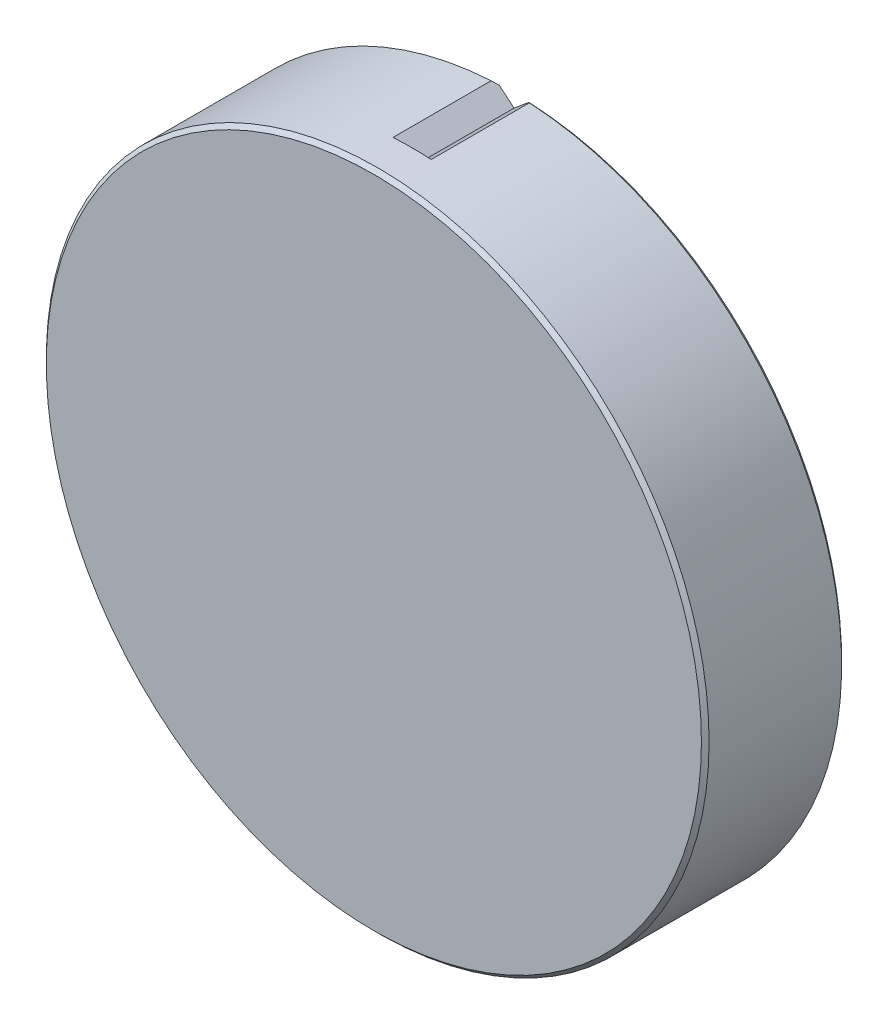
ISO-10303-21;
HEADER;
FILE_DESCRIPTION(('STEP AP214'),'2;1');
FILE_NAME('part.step','',(''),(''),'','','');
FILE_SCHEMA(('AUTOMOTIVE_DESIGN { 1 0 10303 214 1 1 1 1 }'));
ENDSEC;
DATA;
#1=APPLICATION_CONTEXT('core data for automotive mechanical design processes');
#2=APPLICATION_PROTOCOL_DEFINITION('international standard','automotive_design',2000,#1);
#3=PRODUCT_CONTEXT('',#1,'mechanical');
#4=PRODUCT('Part','Part','',(#3));
#5=PRODUCT_RELATED_PRODUCT_CATEGORY('part','',(#4));
#6=PRODUCT_DEFINITION_FORMATION('','',#4);
#7=PRODUCT_DEFINITION_CONTEXT('part definition',#1,'design');
#8=PRODUCT_DEFINITION('design','',#6,#7);
#9=PRODUCT_DEFINITION_SHAPE('','',#8);
#10=(LENGTH_UNIT() NAMED_UNIT(*) SI_UNIT(.MILLI.,.METRE.));
#11=(NAMED_UNIT(*) PLANE_ANGLE_UNIT() SI_UNIT($,.RADIAN.));
#12=(NAMED_UNIT(*) SI_UNIT($,.STERADIAN.) SOLID_ANGLE_UNIT());
#13=UNCERTAINTY_MEASURE_WITH_UNIT(LENGTH_MEASURE(1.E-05),#10,'distance_accuracy_value','');
#14=(GEOMETRIC_REPRESENTATION_CONTEXT(3) GLOBAL_UNCERTAINTY_ASSIGNED_CONTEXT((#13)) GLOBAL_UNIT_ASSIGNED_CONTEXT((#10,
#11,#12)) REPRESENTATION_CONTEXT('',''));
#15=CARTESIAN_POINT('',(0.,0.,0.));
#16=DIRECTION('',(0.,0.,1.));
#17=DIRECTION('',(1.,0.,0.));
#18=AXIS2_PLACEMENT_3D('',#15,#16,#17);
#19=CARTESIAN_POINT('',(0.,0.,-78.8));
#20=DIRECTION('',(0.,0.,1.));
#21=DIRECTION('',(1.,0.,0.));
#22=AXIS2_PLACEMENT_3D('',#19,#20,#21);
#23=PLANE('',#22);
#24=CARTESIAN_POINT('',(15.5563491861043,-15.5563491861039,-78.8));
#25=DIRECTION('',(0.,0.,-1.));
#26=DIRECTION('',(-1.,0.,0.));
#27=AXIS2_PLACEMENT_3D('',#24,#25,#26);
#28=CIRCLE('',#27,2.);
#29=CARTESIAN_POINT('',(13.5563491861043,-15.5563491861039,-78.8));
#30=VERTEX_POINT('',#29);
#31=EDGE_CURVE('E85',#30,#30,#28,.T.);
#32=ORIENTED_EDGE('',*,*,#31,.F.);
#33=EDGE_LOOP('',(#32));
#34=FACE_BOUND('',#33,.T.);
#35=CARTESIAN_POINT('',(2.24778758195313E-13,-22.,-78.8));
#36=DIRECTION('',(0.,0.,-1.));
#37=DIRECTION('',(-1.,0.,0.));
#38=AXIS2_PLACEMENT_3D('',#35,#36,#37);
#39=CIRCLE('',#38,2.);
#40=CARTESIAN_POINT('',(-1.99999999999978,-22.,-78.8));
#41=VERTEX_POINT('',#40);
#42=EDGE_CURVE('E94',#41,#41,#39,.T.);
#43=ORIENTED_EDGE('',*,*,#42,.F.);
#44=EDGE_LOOP('',(#43));
#45=FACE_BOUND('',#44,.T.);
#46=CARTESIAN_POINT('',(-22.,0.,-78.8));
#47=DIRECTION('',(0.,0.,-1.));
#48=DIRECTION('',(-1.,0.,0.));
#49=AXIS2_PLACEMENT_3D('',#46,#47,#48);
#50=CIRCLE('',#49,2.);
#51=CARTESIAN_POINT('',(-24.,0.,-78.8));
#52=VERTEX_POINT('',#51);
#53=EDGE_CURVE('E103',#52,#52,#50,.T.);
#54=ORIENTED_EDGE('',*,*,#53,.F.);
#55=EDGE_LOOP('',(#54));
#56=FACE_BOUND('',#55,.T.);
#57=CARTESIAN_POINT('',(-15.5563491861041,15.556349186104,-78.8));
#58=DIRECTION('',(0.,0.,-1.));
#59=DIRECTION('',(-1.,0.,0.));
#60=AXIS2_PLACEMENT_3D('',#57,#58,#59);
#61=CIRCLE('',#60,2.);
#62=CARTESIAN_POINT('',(-17.5563491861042,15.556349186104,-78.8));
#63=VERTEX_POINT('',#62);
#64=EDGE_CURVE('E112',#63,#63,#61,.T.);
#65=ORIENTED_EDGE('',*,*,#64,.F.);
#66=EDGE_LOOP('',(#65));
#67=FACE_BOUND('',#66,.T.);
#68=CARTESIAN_POINT('',(0.,22.,-78.8));
#69=DIRECTION('',(0.,0.,-1.));
#70=DIRECTION('',(-1.,0.,0.));
#71=AXIS2_PLACEMENT_3D('',#68,#69,#70);
#72=CIRCLE('',#71,2.);
#73=CARTESIAN_POINT('',(-2.00000000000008,22.,-78.8));
#74=VERTEX_POINT('',#73);
#75=EDGE_CURVE('E121',#74,#74,#72,.T.);
#76=ORIENTED_EDGE('',*,*,#75,.F.);
#77=EDGE_LOOP('',(#76));
#78=FACE_BOUND('',#77,.T.);
#79=CARTESIAN_POINT('',(22.,0.,-78.8));
#80=DIRECTION('',(0.,0.,-1.));
#81=DIRECTION('',(-1.,0.,0.));
#82=AXIS2_PLACEMENT_3D('',#79,#80,#81);
#83=CIRCLE('',#82,2.);
#84=CARTESIAN_POINT('',(20.,0.,-78.8));
#85=VERTEX_POINT('',#84);
#86=EDGE_CURVE('E130',#85,#85,#83,.T.);
#87=ORIENTED_EDGE('',*,*,#86,.F.);
#88=EDGE_LOOP('',(#87));
#89=FACE_BOUND('',#88,.T.);
#90=CARTESIAN_POINT('',(-15.5563491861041,-15.556349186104,-78.8));
#91=DIRECTION('',(0.,0.,-1.));
#92=DIRECTION('',(-1.,0.,0.));
#93=AXIS2_PLACEMENT_3D('',#90,#91,#92);
#94=CIRCLE('',#93,2.);
#95=CARTESIAN_POINT('',(-17.5563491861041,-15.556349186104,-78.8));
#96=VERTEX_POINT('',#95);
#97=EDGE_CURVE('E139',#96,#96,#94,.T.);
#98=ORIENTED_EDGE('',*,*,#97,.F.);
#99=EDGE_LOOP('',(#98));
#100=FACE_BOUND('',#99,.T.);
#101=CARTESIAN_POINT('',(15.556349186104,15.556349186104,-78.8));
#102=DIRECTION('',(0.,0.,-1.));
#103=DIRECTION('',(-1.,0.,0.));
#104=AXIS2_PLACEMENT_3D('',#101,#102,#103);
#105=CIRCLE('',#104,2.);
#106=CARTESIAN_POINT('',(13.556349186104,15.556349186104,-78.8));
#107=VERTEX_POINT('',#106);
#108=EDGE_CURVE('E145',#107,#107,#105,.T.);
#109=ORIENTED_EDGE('',*,*,#108,.F.);
#110=EDGE_LOOP('',(#109));
#111=FACE_BOUND('',#110,.T.);
#112=CARTESIAN_POINT('',(0.,0.,-78.8));
#113=DIRECTION('',(0.,0.,1.));
#114=DIRECTION('',(1.,0.,0.));
#115=AXIS2_PLACEMENT_3D('',#112,#113,#114);
#116=CIRCLE('',#115,17.5);
#117=CARTESIAN_POINT('',(17.5,0.,-78.8));
#118=VERTEX_POINT('',#117);
#119=EDGE_CURVE('E164',#118,#118,#116,.T.);
#120=ORIENTED_EDGE('',*,*,#119,.T.);
#121=EDGE_LOOP('',(#120));
#122=FACE_BOUND('',#121,.T.);
#123=CARTESIAN_POINT('',(0.,0.,-78.8));
#124=DIRECTION('',(0.,0.,1.));
#125=DIRECTION('',(1.,0.,0.));
#126=AXIS2_PLACEMENT_3D('',#123,#124,#125);
#127=CIRCLE('',#126,25.7);
#128=CARTESIAN_POINT('',(1.16272163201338,25.6736845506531,-78.8));
#129=VERTEX_POINT('',#128);
#130=CARTESIAN_POINT('',(-1.16272163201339,25.6736845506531,-78.8));
#131=VERTEX_POINT('',#130);
#132=EDGE_CURVE('E155',#129,#131,#127,.F.);
#133=ORIENTED_EDGE('',*,*,#132,.T.);
#134=DIRECTION('',(-0.766044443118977,0.64278760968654,0.));
#135=VECTOR('',#134,1.);
#136=CARTESIAN_POINT('',(0.,24.6980452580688,-78.8));
#137=LINE('',#136,#135);
#138=CARTESIAN_POINT('',(0.,24.6980452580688,-78.8));
#139=VERTEX_POINT('',#138);
#140=EDGE_CURVE('E72',#139,#131,#137,.T.);
#141=ORIENTED_EDGE('',*,*,#140,.F.);
#142=DIRECTION('',(-0.766044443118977,-0.64278760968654,0.));
#143=VECTOR('',#142,1.);
#144=CARTESIAN_POINT('',(1.5,25.9566947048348,-78.8));
#145=LINE('',#144,#143);
#146=EDGE_CURVE('E596',#129,#139,#145,.T.);
#147=ORIENTED_EDGE('',*,*,#146,.F.);
#148=EDGE_LOOP('',(#133,#141,#147));
#149=FACE_BOUND('',#148,.T.);
#150=ADVANCED_FACE('F18',(#34,#45,#56,#67,#78,#89,#100,#111,#122,#149),#23,.F.);
#151=CARTESIAN_POINT('',(0.,0.,-67.8));
#152=DIRECTION('',(0.,0.,-1.));
#153=DIRECTION('',(-1.,0.,0.));
#154=AXIS2_PLACEMENT_3D('',#151,#152,#153);
#155=CYLINDRICAL_SURFACE('',#154,26.);
#156=CARTESIAN_POINT('',(0.,0.,-70.8));
#157=DIRECTION('',(0.,0.,1.));
#158=DIRECTION('',(1.,0.,0.));
#159=AXIS2_PLACEMENT_3D('',#156,#157,#158);
#160=CIRCLE('',#159,26.);
#161=CARTESIAN_POINT('',(1.5,25.9566947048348,-70.8));
#162=VERTEX_POINT('',#161);
#163=CARTESIAN_POINT('',(-1.5,25.9566947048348,-70.8));
#164=VERTEX_POINT('',#163);
#165=EDGE_CURVE('E11',#162,#164,#160,.T.);
#166=ORIENTED_EDGE('',*,*,#165,.T.);
#167=DIRECTION('',(0.,0.,-1.));
#168=VECTOR('',#167,1.);
#169=CARTESIAN_POINT('',(-1.5,25.9566947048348,-70.8));
#170=LINE('',#169,#168);
#171=CARTESIAN_POINT('',(-1.5,25.9566947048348,-78.5));
#172=VERTEX_POINT('',#171);
#173=EDGE_CURVE('E80',#164,#172,#170,.T.);
#174=ORIENTED_EDGE('',*,*,#173,.T.);
#175=CARTESIAN_POINT('',(0.,0.,-78.5));
#176=DIRECTION('',(0.,0.,1.));
#177=DIRECTION('',(1.,0.,0.));
#178=AXIS2_PLACEMENT_3D('',#175,#176,#177);
#179=CIRCLE('',#178,26.);
#180=CARTESIAN_POINT('',(1.5,25.9566947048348,-78.5));
#181=VERTEX_POINT('',#180);
#182=EDGE_CURVE('E78',#172,#181,#179,.T.);
#183=ORIENTED_EDGE('',*,*,#182,.T.);
#184=DIRECTION('',(0.,0.,-1.));
#185=VECTOR('',#184,1.);
#186=CARTESIAN_POINT('',(1.5,25.9566947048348,-70.8));
#187=LINE('',#186,#185);
#188=EDGE_CURVE('E33',#162,#181,#187,.T.);
#189=ORIENTED_EDGE('',*,*,#188,.F.);
#190=EDGE_LOOP('',(#166,#174,#183,#189));
#191=FACE_BOUND('',#190,.T.);
#192=CARTESIAN_POINT('',(0.,0.,-68.1));
#193=DIRECTION('',(0.,0.,1.));
#194=DIRECTION('',(1.,0.,0.));
#195=AXIS2_PLACEMENT_3D('',#192,#193,#194);
#196=CIRCLE('',#195,26.);
#197=CARTESIAN_POINT('',(26.,0.,-68.1));
#198=VERTEX_POINT('',#197);
#199=EDGE_CURVE('E151',#198,#198,#196,.F.);
#200=ORIENTED_EDGE('',*,*,#199,.T.);
#201=EDGE_LOOP('',(#200));
#202=FACE_BOUND('',#201,.T.);
#203=ADVANCED_FACE('F75',(#191,#202),#155,.T.);
#204=CARTESIAN_POINT('',(0.,0.,-67.8));
#205=DIRECTION('',(0.,0.,1.));
#206=DIRECTION('',(1.,0.,0.));
#207=AXIS2_PLACEMENT_3D('',#204,#205,#206);
#208=PLANE('',#207);
#209=CARTESIAN_POINT('',(0.,0.,-67.8));
#210=DIRECTION('',(0.,0.,1.));
#211=DIRECTION('',(1.,0.,0.));
#212=AXIS2_PLACEMENT_3D('',#209,#210,#211);
#213=CIRCLE('',#212,25.7);
#214=CARTESIAN_POINT('',(25.7,0.,-67.8));
#215=VERTEX_POINT('',#214);
#216=EDGE_CURVE('E158',#215,#215,#213,.T.);
#217=ORIENTED_EDGE('',*,*,#216,.T.);
#218=EDGE_LOOP('',(#217));
#219=FACE_BOUND('',#218,.T.);
#220=ADVANCED_FACE('F294',(#219),#208,.T.);
#221=CARTESIAN_POINT('',(0.,0.,-78.5));
#222=DIRECTION('',(0.,0.,1.));
#223=DIRECTION('',(1.,0.,0.));
#224=AXIS2_PLACEMENT_3D('',#221,#222,#223);
#225=CONICAL_SURFACE('',#224,26.,0.785398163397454);
#226=CARTESIAN_POINT('',(-1.16249525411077,25.6734945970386,-78.8002));
#227=CARTESIAN_POINT('',(-1.21889902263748,25.7208229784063,-78.7503660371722));
#228=CARTESIAN_POINT('',(-1.27524296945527,25.7681011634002,-78.7004174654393));
#229=CARTESIAN_POINT('',(-1.38781121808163,25.8625571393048,-78.6002911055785));
#230=CARTESIAN_POINT('',(-1.44403551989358,25.9097349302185,-78.5501133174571));
#231=CARTESIAN_POINT('',(-1.5002,25.956862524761,-78.499820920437));
#232=B_SPLINE_CURVE_WITH_KNOTS('',3,(#226,#227,#228,#229,#230,#231),.UNSPECIFIED.,.F.,.F.,(4,2,
4),(0.,0.266725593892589,0.53345118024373),.UNSPECIFIED.);
#233=EDGE_CURVE('E26',#131,#172,#232,.T.);
#234=ORIENTED_EDGE('',*,*,#233,.F.);
#235=ORIENTED_EDGE('',*,*,#132,.F.);
#236=CARTESIAN_POINT('',(1.5002,25.956862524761,-78.499820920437));
#237=CARTESIAN_POINT('',(1.44403551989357,25.9097349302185,-78.5501133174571));
#238=CARTESIAN_POINT('',(1.38781121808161,25.8625571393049,-78.6002911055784));
#239=CARTESIAN_POINT('',(1.27524296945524,25.7681011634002,-78.7004174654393));
#240=CARTESIAN_POINT('',(1.21889902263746,25.7208229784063,-78.7503660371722));
#241=CARTESIAN_POINT('',(1.16249525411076,25.6734945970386,-78.8002));
#242=B_SPLINE_CURVE_WITH_KNOTS('',3,(#236,#237,#238,#239,#240,#241),.UNSPECIFIED.,.F.,.F.,(4,2,
4),(0.,0.266725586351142,0.533451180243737),.UNSPECIFIED.);
#243=EDGE_CURVE('E173',#181,#129,#242,.T.);
#244=ORIENTED_EDGE('',*,*,#243,.F.);
#245=ORIENTED_EDGE('',*,*,#182,.F.);
#246=EDGE_LOOP('',(#234,#235,#244,#245));
#247=FACE_BOUND('',#246,.T.);
#248=ADVANCED_FACE('F186',(#247),#225,.T.);
#249=CARTESIAN_POINT('',(0.,0.,-67.8));
#250=DIRECTION('',(0.,0.,-1.));
#251=DIRECTION('',(-1.,0.,0.));
#252=AXIS2_PLACEMENT_3D('',#249,#250,#251);
#253=CONICAL_SURFACE('',#252,25.7,0.785398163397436);
#254=ORIENTED_EDGE('',*,*,#199,.F.);
#255=EDGE_LOOP('',(#254));
#256=FACE_BOUND('',#255,.T.);
#257=ORIENTED_EDGE('',*,*,#216,.F.);
#258=EDGE_LOOP('',(#257));
#259=FACE_BOUND('',#258,.T.);
#260=ADVANCED_FACE('F292',(#256,#259),#253,.T.);
#261=CARTESIAN_POINT('',(0.,0.,-74.8));
#262=DIRECTION('',(0.,0.,1.));
#263=DIRECTION('',(1.,0.,0.));
#264=AXIS2_PLACEMENT_3D('',#261,#262,#263);
#265=PLANE('',#264);
#266=CARTESIAN_POINT('',(0.,0.,-74.8));
#267=DIRECTION('',(0.,0.,1.));
#268=DIRECTION('',(1.,0.,0.));
#269=AXIS2_PLACEMENT_3D('',#266,#267,#268);
#270=CIRCLE('',#269,16.8);
#271=CARTESIAN_POINT('',(16.8,0.,-74.8));
#272=VERTEX_POINT('',#271);
#273=EDGE_CURVE('E167',#272,#272,#270,.F.);
#274=ORIENTED_EDGE('',*,*,#273,.T.);
#275=EDGE_LOOP('',(#274));
#276=FACE_BOUND('',#275,.T.);
#277=ADVANCED_FACE('F288',(#276),#265,.F.);
#278=CARTESIAN_POINT('',(0.,0.,-23.7167388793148));
#279=DIRECTION('',(0.,0.,-1.));
#280=DIRECTION('',(-1.,0.,0.));
#281=AXIS2_PLACEMENT_3D('',#278,#279,#280);
#282=CYLINDRICAL_SURFACE('',#281,17.);
#283=CARTESIAN_POINT('',(0.,0.,-75.));
#284=DIRECTION('',(0.,0.,1.));
#285=DIRECTION('',(1.,0.,0.));
#286=AXIS2_PLACEMENT_3D('',#283,#284,#285);
#287=CIRCLE('',#286,17.);
#288=CARTESIAN_POINT('',(17.,0.,-75.));
#289=VERTEX_POINT('',#288);
#290=EDGE_CURVE('E170',#289,#289,#287,.T.);
#291=ORIENTED_EDGE('',*,*,#290,.T.);
#292=EDGE_LOOP('',(#291));
#293=FACE_BOUND('',#292,.T.);
#294=CARTESIAN_POINT('',(0.,0.,-78.3));
#295=DIRECTION('',(0.,0.,1.));
#296=DIRECTION('',(1.,0.,0.));
#297=AXIS2_PLACEMENT_3D('',#294,#295,#296);
#298=CIRCLE('',#297,17.);
#299=CARTESIAN_POINT('',(17.,0.,-78.3));
#300=VERTEX_POINT('',#299);
#301=EDGE_CURVE('E161',#300,#300,#298,.F.);
#302=ORIENTED_EDGE('',*,*,#301,.T.);
#303=EDGE_LOOP('',(#302));
#304=FACE_BOUND('',#303,.T.);
#305=ADVANCED_FACE('F284',(#293,#304),#282,.F.);
#306=CARTESIAN_POINT('',(0.,0.,-78.3));
#307=DIRECTION('',(0.,0.,-1.));
#308=DIRECTION('',(-1.,0.,0.));
#309=AXIS2_PLACEMENT_3D('',#306,#307,#308);
#310=CONICAL_SURFACE('',#309,17.,0.785398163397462);
#311=ORIENTED_EDGE('',*,*,#119,.F.);
#312=EDGE_LOOP('',(#311));
#313=FACE_BOUND('',#312,.T.);
#314=ORIENTED_EDGE('',*,*,#301,.F.);
#315=EDGE_LOOP('',(#314));
#316=FACE_BOUND('',#315,.T.);
#317=ADVANCED_FACE('F287',(#313,#316),#310,.F.);
#318=CARTESIAN_POINT('',(0.,0.,-75.));
#319=DIRECTION('',(0.,0.,1.));
#320=DIRECTION('',(1.,0.,0.));
#321=AXIS2_PLACEMENT_3D('',#318,#319,#320);
#322=TOROIDAL_SURFACE('',#321,16.8,0.2);
#323=ORIENTED_EDGE('',*,*,#290,.F.);
#324=EDGE_LOOP('',(#323));
#325=FACE_BOUND('',#324,.T.);
#326=ORIENTED_EDGE('',*,*,#273,.F.);
#327=EDGE_LOOP('',(#326));
#328=FACE_BOUND('',#327,.T.);
#329=ADVANCED_FACE('F20',(#325,#328),#322,.F.);
#330=CARTESIAN_POINT('',(15.556349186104,15.556349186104,-73.8));
#331=DIRECTION('',(0.,0.,-1.));
#332=DIRECTION('',(-1.,0.,0.));
#333=AXIS2_PLACEMENT_3D('',#330,#331,#332);
#334=CONICAL_SURFACE('',#333,2.,1.02974425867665);
#335=CARTESIAN_POINT('',(15.556349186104,15.556349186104,-72.5982787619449));
#336=VERTEX_POINT('',#335);
#337=VERTEX_LOOP('',#336);
#338=FACE_BOUND('',#337,.T.);
#339=CARTESIAN_POINT('',(15.556349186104,15.556349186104,-73.8));
#340=DIRECTION('',(0.,0.,-1.));
#341=DIRECTION('',(-1.,0.,0.));
#342=AXIS2_PLACEMENT_3D('',#339,#340,#341);
#343=CIRCLE('',#342,2.);
#344=CARTESIAN_POINT('',(13.556349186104,15.556349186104,-73.8));
#345=VERTEX_POINT('',#344);
#346=EDGE_CURVE('E148',#345,#345,#343,.T.);
#347=ORIENTED_EDGE('',*,*,#346,.T.);
#348=EDGE_LOOP('',(#347));
#349=FACE_BOUND('',#348,.T.);
#350=ADVANCED_FACE('F280',(#338,#349),#334,.F.);
#351=CARTESIAN_POINT('',(15.556349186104,15.556349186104,-78.8));
#352=DIRECTION('',(0.,0.,-1.));
#353=DIRECTION('',(-1.,0.,0.));
#354=AXIS2_PLACEMENT_3D('',#351,#352,#353);
#355=CYLINDRICAL_SURFACE('',#354,2.);
#356=ORIENTED_EDGE('',*,*,#346,.F.);
#357=EDGE_LOOP('',(#356));
#358=FACE_BOUND('',#357,.T.);
#359=ORIENTED_EDGE('',*,*,#108,.T.);
#360=EDGE_LOOP('',(#359));
#361=FACE_BOUND('',#360,.T.);
#362=ADVANCED_FACE('F276',(#358,#361),#355,.F.);
#363=CARTESIAN_POINT('',(-15.5563491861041,-15.556349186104,-73.8));
#364=DIRECTION('',(0.,0.,-1.));
#365=DIRECTION('',(-1.,0.,0.));
#366=AXIS2_PLACEMENT_3D('',#363,#364,#365);
#367=CONICAL_SURFACE('',#366,2.,1.02974425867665);
#368=CARTESIAN_POINT('',(-15.5563491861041,-15.556349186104,-72.5982787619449));
#369=VERTEX_POINT('',#368);
#370=VERTEX_LOOP('',#369);
#371=FACE_BOUND('',#370,.T.);
#372=CARTESIAN_POINT('',(-15.5563491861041,-15.556349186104,-73.8));
#373=DIRECTION('',(0.,0.,-1.));
#374=DIRECTION('',(-1.,0.,0.));
#375=AXIS2_PLACEMENT_3D('',#372,#373,#374);
#376=CIRCLE('',#375,2.);
#377=CARTESIAN_POINT('',(-17.5563491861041,-15.556349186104,-73.8));
#378=VERTEX_POINT('',#377);
#379=EDGE_CURVE('E142',#378,#378,#376,.T.);
#380=ORIENTED_EDGE('',*,*,#379,.T.);
#381=EDGE_LOOP('',(#380));
#382=FACE_BOUND('',#381,.T.);
#383=ADVANCED_FACE('F272',(#371,#382),#367,.F.);
#384=CARTESIAN_POINT('',(-15.5563491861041,-15.556349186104,-78.8));
#385=DIRECTION('',(0.,0.,-1.));
#386=DIRECTION('',(-1.,0.,0.));
#387=AXIS2_PLACEMENT_3D('',#384,#385,#386);
#388=CYLINDRICAL_SURFACE('',#387,2.);
#389=ORIENTED_EDGE('',*,*,#379,.F.);
#390=EDGE_LOOP('',(#389));
#391=FACE_BOUND('',#390,.T.);
#392=ORIENTED_EDGE('',*,*,#97,.T.);
#393=EDGE_LOOP('',(#392));
#394=FACE_BOUND('',#393,.T.);
#395=ADVANCED_FACE('F268',(#391,#394),#388,.F.);
#396=CARTESIAN_POINT('',(22.,0.,-78.8));
#397=DIRECTION('',(0.,0.,-1.));
#398=DIRECTION('',(-1.,0.,0.));
#399=AXIS2_PLACEMENT_3D('',#396,#397,#398);
#400=CYLINDRICAL_SURFACE('',#399,1.65);
#401=CARTESIAN_POINT('',(22.,0.,-69.3));
#402=DIRECTION('',(0.,0.,1.));
#403=DIRECTION('',(1.,0.,0.));
#404=AXIS2_PLACEMENT_3D('',#401,#402,#403);
#405=CIRCLE('',#404,1.65);
#406=CARTESIAN_POINT('',(23.65,0.,-69.3));
#407=VERTEX_POINT('',#406);
#408=EDGE_CURVE('E595',#407,#407,#405,.F.);
#409=ORIENTED_EDGE('',*,*,#408,.F.);
#410=EDGE_LOOP('',(#409));
#411=FACE_BOUND('',#410,.T.);
#412=CARTESIAN_POINT('',(22.,0.,-70.8));
#413=DIRECTION('',(0.,0.,-1.));
#414=DIRECTION('',(-1.,0.,0.));
#415=AXIS2_PLACEMENT_3D('',#412,#413,#414);
#416=CIRCLE('',#415,1.65);
#417=CARTESIAN_POINT('',(20.35,0.,-70.8));
#418=VERTEX_POINT('',#417);
#419=EDGE_CURVE('E136',#418,#418,#416,.T.);
#420=ORIENTED_EDGE('',*,*,#419,.T.);
#421=EDGE_LOOP('',(#420));
#422=FACE_BOUND('',#421,.T.);
#423=ADVANCED_FACE('F264',(#411,#422),#400,.F.);
#424=CARTESIAN_POINT('',(23.65,0.,-70.8));
#425=DIRECTION('',(0.,0.,1.));
#426=DIRECTION('',(1.,0.,0.));
#427=AXIS2_PLACEMENT_3D('',#424,#425,#426);
#428=PLANE('',#427);
#429=ORIENTED_EDGE('',*,*,#419,.F.);
#430=EDGE_LOOP('',(#429));
#431=FACE_BOUND('',#430,.T.);
#432=CARTESIAN_POINT('',(22.,0.,-70.8));
#433=DIRECTION('',(0.,0.,-1.));
#434=DIRECTION('',(-1.,0.,0.));
#435=AXIS2_PLACEMENT_3D('',#432,#433,#434);
#436=CIRCLE('',#435,2.);
#437=CARTESIAN_POINT('',(20.,0.,-70.8));
#438=VERTEX_POINT('',#437);
#439=EDGE_CURVE('E133',#438,#438,#436,.T.);
#440=ORIENTED_EDGE('',*,*,#439,.T.);
#441=EDGE_LOOP('',(#440));
#442=FACE_BOUND('',#441,.T.);
#443=ADVANCED_FACE('F260',(#431,#442),#428,.F.);
#444=CARTESIAN_POINT('',(22.,0.,-78.8));
#445=DIRECTION('',(0.,0.,-1.));
#446=DIRECTION('',(-1.,0.,0.));
#447=AXIS2_PLACEMENT_3D('',#444,#445,#446);
#448=CYLINDRICAL_SURFACE('',#447,2.);
#449=ORIENTED_EDGE('',*,*,#439,.F.);
#450=EDGE_LOOP('',(#449));
#451=FACE_BOUND('',#450,.T.);
#452=ORIENTED_EDGE('',*,*,#86,.T.);
#453=EDGE_LOOP('',(#452));
#454=FACE_BOUND('',#453,.T.);
#455=ADVANCED_FACE('F256',(#451,#454),#448,.F.);
#456=CARTESIAN_POINT('',(0.,22.,-78.8));
#457=DIRECTION('',(0.,0.,-1.));
#458=DIRECTION('',(-1.,0.,0.));
#459=AXIS2_PLACEMENT_3D('',#456,#457,#458);
#460=CYLINDRICAL_SURFACE('',#459,1.65);
#461=CARTESIAN_POINT('',(0.,22.,-69.3));
#462=DIRECTION('',(0.,0.,1.));
#463=DIRECTION('',(1.,0.,0.));
#464=AXIS2_PLACEMENT_3D('',#461,#462,#463);
#465=CIRCLE('',#464,1.65);
#466=CARTESIAN_POINT('',(1.64999999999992,22.,-69.3));
#467=VERTEX_POINT('',#466);
#468=EDGE_CURVE('E597',#467,#467,#465,.F.);
#469=ORIENTED_EDGE('',*,*,#468,.F.);
#470=EDGE_LOOP('',(#469));
#471=FACE_BOUND('',#470,.T.);
#472=CARTESIAN_POINT('',(0.,22.,-70.8));
#473=DIRECTION('',(0.,0.,-1.));
#474=DIRECTION('',(-1.,0.,0.));
#475=AXIS2_PLACEMENT_3D('',#472,#473,#474);
#476=CIRCLE('',#475,1.65);
#477=CARTESIAN_POINT('',(-1.65000000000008,22.,-70.8));
#478=VERTEX_POINT('',#477);
#479=EDGE_CURVE('E127',#478,#478,#476,.T.);
#480=ORIENTED_EDGE('',*,*,#479,.T.);
#481=EDGE_LOOP('',(#480));
#482=FACE_BOUND('',#481,.T.);
#483=ADVANCED_FACE('F252',(#471,#482),#460,.F.);
#484=CARTESIAN_POINT('',(1.64999999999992,22.,-70.8));
#485=DIRECTION('',(0.,0.,1.));
#486=DIRECTION('',(1.,0.,0.));
#487=AXIS2_PLACEMENT_3D('',#484,#485,#486);
#488=PLANE('',#487);
#489=ORIENTED_EDGE('',*,*,#479,.F.);
#490=EDGE_LOOP('',(#489));
#491=FACE_BOUND('',#490,.T.);
#492=CARTESIAN_POINT('',(0.,22.,-70.8));
#493=DIRECTION('',(0.,0.,-1.));
#494=DIRECTION('',(-1.,0.,0.));
#495=AXIS2_PLACEMENT_3D('',#492,#493,#494);
#496=CIRCLE('',#495,2.);
#497=CARTESIAN_POINT('',(-2.00000000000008,22.,-70.8));
#498=VERTEX_POINT('',#497);
#499=EDGE_CURVE('E124',#498,#498,#496,.T.);
#500=ORIENTED_EDGE('',*,*,#499,.T.);
#501=EDGE_LOOP('',(#500));
#502=FACE_BOUND('',#501,.T.);
#503=ADVANCED_FACE('F248',(#491,#502),#488,.F.);
#504=CARTESIAN_POINT('',(0.,22.,-78.8));
#505=DIRECTION('',(0.,0.,-1.));
#506=DIRECTION('',(-1.,0.,0.));
#507=AXIS2_PLACEMENT_3D('',#504,#505,#506);
#508=CYLINDRICAL_SURFACE('',#507,2.);
#509=ORIENTED_EDGE('',*,*,#499,.F.);
#510=EDGE_LOOP('',(#509));
#511=FACE_BOUND('',#510,.T.);
#512=ORIENTED_EDGE('',*,*,#75,.T.);
#513=EDGE_LOOP('',(#512));
#514=FACE_BOUND('',#513,.T.);
#515=ADVANCED_FACE('F244',(#511,#514),#508,.F.);
#516=CARTESIAN_POINT('',(-15.5563491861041,15.556349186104,-78.8));
#517=DIRECTION('',(0.,0.,-1.));
#518=DIRECTION('',(-1.,0.,0.));
#519=AXIS2_PLACEMENT_3D('',#516,#517,#518);
#520=CYLINDRICAL_SURFACE('',#519,1.65);
#521=CARTESIAN_POINT('',(-15.5563491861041,15.556349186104,-69.3));
#522=DIRECTION('',(0.,0.,1.));
#523=DIRECTION('',(1.,0.,0.));
#524=AXIS2_PLACEMENT_3D('',#521,#522,#523);
#525=CIRCLE('',#524,1.65);
#526=CARTESIAN_POINT('',(-13.9063491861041,15.556349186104,-69.3));
#527=VERTEX_POINT('',#526);
#528=EDGE_CURVE('E601',#527,#527,#525,.F.);
#529=ORIENTED_EDGE('',*,*,#528,.F.);
#530=EDGE_LOOP('',(#529));
#531=FACE_BOUND('',#530,.T.);
#532=CARTESIAN_POINT('',(-15.5563491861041,15.556349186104,-70.8));
#533=DIRECTION('',(0.,0.,-1.));
#534=DIRECTION('',(-1.,0.,0.));
#535=AXIS2_PLACEMENT_3D('',#532,#533,#534);
#536=CIRCLE('',#535,1.65);
#537=CARTESIAN_POINT('',(-17.2063491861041,15.556349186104,-70.8));
#538=VERTEX_POINT('',#537);
#539=EDGE_CURVE('E118',#538,#538,#536,.T.);
#540=ORIENTED_EDGE('',*,*,#539,.T.);
#541=EDGE_LOOP('',(#540));
#542=FACE_BOUND('',#541,.T.);
#543=ADVANCED_FACE('F240',(#531,#542),#520,.F.);
#544=CARTESIAN_POINT('',(-13.9063491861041,15.556349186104,-70.8));
#545=DIRECTION('',(0.,0.,1.));
#546=DIRECTION('',(1.,0.,0.));
#547=AXIS2_PLACEMENT_3D('',#544,#545,#546);
#548=PLANE('',#547);
#549=ORIENTED_EDGE('',*,*,#539,.F.);
#550=EDGE_LOOP('',(#549));
#551=FACE_BOUND('',#550,.T.);
#552=CARTESIAN_POINT('',(-15.5563491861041,15.556349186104,-70.8));
#553=DIRECTION('',(0.,0.,-1.));
#554=DIRECTION('',(-1.,0.,0.));
#555=AXIS2_PLACEMENT_3D('',#552,#553,#554);
#556=CIRCLE('',#555,2.);
#557=CARTESIAN_POINT('',(-17.5563491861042,15.556349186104,-70.8));
#558=VERTEX_POINT('',#557);
#559=EDGE_CURVE('E115',#558,#558,#556,.T.);
#560=ORIENTED_EDGE('',*,*,#559,.T.);
#561=EDGE_LOOP('',(#560));
#562=FACE_BOUND('',#561,.T.);
#563=ADVANCED_FACE('F236',(#551,#562),#548,.F.);
#564=CARTESIAN_POINT('',(-15.5563491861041,15.556349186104,-78.8));
#565=DIRECTION('',(0.,0.,-1.));
#566=DIRECTION('',(-1.,0.,0.));
#567=AXIS2_PLACEMENT_3D('',#564,#565,#566);
#568=CYLINDRICAL_SURFACE('',#567,2.);
#569=ORIENTED_EDGE('',*,*,#559,.F.);
#570=EDGE_LOOP('',(#569));
#571=FACE_BOUND('',#570,.T.);
#572=ORIENTED_EDGE('',*,*,#64,.T.);
#573=EDGE_LOOP('',(#572));
#574=FACE_BOUND('',#573,.T.);
#575=ADVANCED_FACE('F232',(#571,#574),#568,.F.);
#576=CARTESIAN_POINT('',(-22.,0.,-78.8));
#577=DIRECTION('',(0.,0.,-1.));
#578=DIRECTION('',(-1.,0.,0.));
#579=AXIS2_PLACEMENT_3D('',#576,#577,#578);
#580=CYLINDRICAL_SURFACE('',#579,1.65);
#581=CARTESIAN_POINT('',(-22.,0.,-69.3));
#582=DIRECTION('',(0.,0.,1.));
#583=DIRECTION('',(1.,0.,0.));
#584=AXIS2_PLACEMENT_3D('',#581,#582,#583);
#585=CIRCLE('',#584,1.65);
#586=CARTESIAN_POINT('',(-20.35,0.,-69.3));
#587=VERTEX_POINT('',#586);
#588=EDGE_CURVE('E612',#587,#587,#585,.F.);
#589=ORIENTED_EDGE('',*,*,#588,.F.);
#590=EDGE_LOOP('',(#589));
#591=FACE_BOUND('',#590,.T.);
#592=CARTESIAN_POINT('',(-22.,0.,-70.8));
#593=DIRECTION('',(0.,0.,-1.));
#594=DIRECTION('',(-1.,0.,0.));
#595=AXIS2_PLACEMENT_3D('',#592,#593,#594);
#596=CIRCLE('',#595,1.65);
#597=CARTESIAN_POINT('',(-23.65,0.,-70.8));
#598=VERTEX_POINT('',#597);
#599=EDGE_CURVE('E109',#598,#598,#596,.T.);
#600=ORIENTED_EDGE('',*,*,#599,.T.);
#601=EDGE_LOOP('',(#600));
#602=FACE_BOUND('',#601,.T.);
#603=ADVANCED_FACE('F228',(#591,#602),#580,.F.);
#604=CARTESIAN_POINT('',(-20.35,0.,-70.8));
#605=DIRECTION('',(0.,0.,1.));
#606=DIRECTION('',(1.,0.,0.));
#607=AXIS2_PLACEMENT_3D('',#604,#605,#606);
#608=PLANE('',#607);
#609=ORIENTED_EDGE('',*,*,#599,.F.);
#610=EDGE_LOOP('',(#609));
#611=FACE_BOUND('',#610,.T.);
#612=CARTESIAN_POINT('',(-22.,0.,-70.8));
#613=DIRECTION('',(0.,0.,-1.));
#614=DIRECTION('',(-1.,0.,0.));
#615=AXIS2_PLACEMENT_3D('',#612,#613,#614);
#616=CIRCLE('',#615,2.);
#617=CARTESIAN_POINT('',(-24.,0.,-70.8));
#618=VERTEX_POINT('',#617);
#619=EDGE_CURVE('E106',#618,#618,#616,.T.);
#620=ORIENTED_EDGE('',*,*,#619,.T.);
#621=EDGE_LOOP('',(#620));
#622=FACE_BOUND('',#621,.T.);
#623=ADVANCED_FACE('F224',(#611,#622),#608,.F.);
#624=CARTESIAN_POINT('',(-22.,0.,-78.8));
#625=DIRECTION('',(0.,0.,-1.));
#626=DIRECTION('',(-1.,0.,0.));
#627=AXIS2_PLACEMENT_3D('',#624,#625,#626);
#628=CYLINDRICAL_SURFACE('',#627,2.);
#629=ORIENTED_EDGE('',*,*,#619,.F.);
#630=EDGE_LOOP('',(#629));
#631=FACE_BOUND('',#630,.T.);
#632=ORIENTED_EDGE('',*,*,#53,.T.);
#633=EDGE_LOOP('',(#632));
#634=FACE_BOUND('',#633,.T.);
#635=ADVANCED_FACE('F220',(#631,#634),#628,.F.);
#636=CARTESIAN_POINT('',(2.24778758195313E-13,-22.,-78.8));
#637=DIRECTION('',(0.,0.,-1.));
#638=DIRECTION('',(-1.,0.,0.));
#639=AXIS2_PLACEMENT_3D('',#636,#637,#638);
#640=CYLINDRICAL_SURFACE('',#639,1.65);
#641=CARTESIAN_POINT('',(2.24778758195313E-13,-22.,-69.3));
#642=DIRECTION('',(0.,0.,1.));
#643=DIRECTION('',(1.,0.,0.));
#644=AXIS2_PLACEMENT_3D('',#641,#642,#643);
#645=CIRCLE('',#644,1.65);
#646=CARTESIAN_POINT('',(1.65000000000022,-22.,-69.3));
#647=VERTEX_POINT('',#646);
#648=EDGE_CURVE('E615',#647,#647,#645,.F.);
#649=ORIENTED_EDGE('',*,*,#648,.F.);
#650=EDGE_LOOP('',(#649));
#651=FACE_BOUND('',#650,.T.);
#652=CARTESIAN_POINT('',(2.24778758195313E-13,-22.,-70.8));
#653=DIRECTION('',(0.,0.,-1.));
#654=DIRECTION('',(-1.,0.,0.));
#655=AXIS2_PLACEMENT_3D('',#652,#653,#654);
#656=CIRCLE('',#655,1.65);
#657=CARTESIAN_POINT('',(-1.64999999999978,-22.,-70.8));
#658=VERTEX_POINT('',#657);
#659=EDGE_CURVE('E100',#658,#658,#656,.T.);
#660=ORIENTED_EDGE('',*,*,#659,.T.);
#661=EDGE_LOOP('',(#660));
#662=FACE_BOUND('',#661,.T.);
#663=ADVANCED_FACE('F216',(#651,#662),#640,.F.);
#664=CARTESIAN_POINT('',(1.65000000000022,-22.,-70.8));
#665=DIRECTION('',(0.,0.,1.));
#666=DIRECTION('',(1.,0.,0.));
#667=AXIS2_PLACEMENT_3D('',#664,#665,#666);
#668=PLANE('',#667);
#669=ORIENTED_EDGE('',*,*,#659,.F.);
#670=EDGE_LOOP('',(#669));
#671=FACE_BOUND('',#670,.T.);
#672=CARTESIAN_POINT('',(2.24778758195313E-13,-22.,-70.8));
#673=DIRECTION('',(0.,0.,-1.));
#674=DIRECTION('',(-1.,0.,0.));
#675=AXIS2_PLACEMENT_3D('',#672,#673,#674);
#676=CIRCLE('',#675,2.);
#677=CARTESIAN_POINT('',(-1.99999999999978,-22.,-70.8));
#678=VERTEX_POINT('',#677);
#679=EDGE_CURVE('E97',#678,#678,#676,.T.);
#680=ORIENTED_EDGE('',*,*,#679,.T.);
#681=EDGE_LOOP('',(#680));
#682=FACE_BOUND('',#681,.T.);
#683=ADVANCED_FACE('F212',(#671,#682),#668,.F.);
#684=CARTESIAN_POINT('',(2.24778758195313E-13,-22.,-78.8));
#685=DIRECTION('',(0.,0.,-1.));
#686=DIRECTION('',(-1.,0.,0.));
#687=AXIS2_PLACEMENT_3D('',#684,#685,#686);
#688=CYLINDRICAL_SURFACE('',#687,2.);
#689=ORIENTED_EDGE('',*,*,#679,.F.);
#690=EDGE_LOOP('',(#689));
#691=FACE_BOUND('',#690,.T.);
#692=ORIENTED_EDGE('',*,*,#42,.T.);
#693=EDGE_LOOP('',(#692));
#694=FACE_BOUND('',#693,.T.);
#695=ADVANCED_FACE('F208',(#691,#694),#688,.F.);
#696=CARTESIAN_POINT('',(15.5563491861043,-15.5563491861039,-78.8));
#697=DIRECTION('',(0.,0.,-1.));
#698=DIRECTION('',(-1.,0.,0.));
#699=AXIS2_PLACEMENT_3D('',#696,#697,#698);
#700=CYLINDRICAL_SURFACE('',#699,1.65);
#701=CARTESIAN_POINT('',(15.5563491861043,-15.5563491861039,-69.3));
#702=DIRECTION('',(0.,0.,1.));
#703=DIRECTION('',(1.,0.,0.));
#704=AXIS2_PLACEMENT_3D('',#701,#702,#703);
#705=CIRCLE('',#704,1.65);
#706=CARTESIAN_POINT('',(17.2063491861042,-15.5563491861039,-69.3));
#707=VERTEX_POINT('',#706);
#708=EDGE_CURVE('E618',#707,#707,#705,.F.);
#709=ORIENTED_EDGE('',*,*,#708,.F.);
#710=EDGE_LOOP('',(#709));
#711=FACE_BOUND('',#710,.T.);
#712=CARTESIAN_POINT('',(15.5563491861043,-15.5563491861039,-70.8));
#713=DIRECTION('',(0.,0.,-1.));
#714=DIRECTION('',(-1.,0.,0.));
#715=AXIS2_PLACEMENT_3D('',#712,#713,#714);
#716=CIRCLE('',#715,1.65);
#717=CARTESIAN_POINT('',(13.9063491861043,-15.5563491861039,-70.8));
#718=VERTEX_POINT('',#717);
#719=EDGE_CURVE('E91',#718,#718,#716,.T.);
#720=ORIENTED_EDGE('',*,*,#719,.T.);
#721=EDGE_LOOP('',(#720));
#722=FACE_BOUND('',#721,.T.);
#723=ADVANCED_FACE('F204',(#711,#722),#700,.F.);
#724=CARTESIAN_POINT('',(17.2063491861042,-15.5563491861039,-70.8));
#725=DIRECTION('',(0.,0.,1.));
#726=DIRECTION('',(1.,0.,0.));
#727=AXIS2_PLACEMENT_3D('',#724,#725,#726);
#728=PLANE('',#727);
#729=ORIENTED_EDGE('',*,*,#719,.F.);
#730=EDGE_LOOP('',(#729));
#731=FACE_BOUND('',#730,.T.);
#732=CARTESIAN_POINT('',(15.5563491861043,-15.5563491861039,-70.8));
#733=DIRECTION('',(0.,0.,-1.));
#734=DIRECTION('',(-1.,0.,0.));
#735=AXIS2_PLACEMENT_3D('',#732,#733,#734);
#736=CIRCLE('',#735,2.);
#737=CARTESIAN_POINT('',(13.5563491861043,-15.5563491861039,-70.8));
#738=VERTEX_POINT('',#737);
#739=EDGE_CURVE('E88',#738,#738,#736,.T.);
#740=ORIENTED_EDGE('',*,*,#739,.T.);
#741=EDGE_LOOP('',(#740));
#742=FACE_BOUND('',#741,.T.);
#743=ADVANCED_FACE('F200',(#731,#742),#728,.F.);
#744=CARTESIAN_POINT('',(15.5563491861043,-15.5563491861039,-78.8));
#745=DIRECTION('',(0.,0.,-1.));
#746=DIRECTION('',(-1.,0.,0.));
#747=AXIS2_PLACEMENT_3D('',#744,#745,#746);
#748=CYLINDRICAL_SURFACE('',#747,2.);
#749=ORIENTED_EDGE('',*,*,#739,.F.);
#750=EDGE_LOOP('',(#749));
#751=FACE_BOUND('',#750,.T.);
#752=ORIENTED_EDGE('',*,*,#31,.T.);
#753=EDGE_LOOP('',(#752));
#754=FACE_BOUND('',#753,.T.);
#755=ADVANCED_FACE('F197',(#751,#754),#748,.F.);
#756=CARTESIAN_POINT('',(0.,0.,-70.8));
#757=DIRECTION('',(0.,0.,1.));
#758=DIRECTION('',(1.,0.,0.));
#759=AXIS2_PLACEMENT_3D('',#756,#757,#758);
#760=PLANE('',#759);
#761=DIRECTION('',(-0.766044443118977,-0.64278760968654,0.));
#762=VECTOR('',#761,1.);
#763=CARTESIAN_POINT('',(1.5,25.9566947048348,-70.8));
#764=LINE('',#763,#762);
#765=CARTESIAN_POINT('',(0.,24.6980452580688,-70.8));
#766=VERTEX_POINT('',#765);
#767=EDGE_CURVE('E64',#162,#766,#764,.T.);
#768=ORIENTED_EDGE('',*,*,#767,.T.);
#769=DIRECTION('',(-0.766044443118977,0.64278760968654,0.));
#770=VECTOR('',#769,1.);
#771=CARTESIAN_POINT('',(0.,24.6980452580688,-70.8));
#772=LINE('',#771,#770);
#773=EDGE_CURVE('E66',#766,#164,#772,.T.);
#774=ORIENTED_EDGE('',*,*,#773,.T.);
#775=ORIENTED_EDGE('',*,*,#165,.F.);
#776=EDGE_LOOP('',(#768,#774,#775));
#777=FACE_BOUND('',#776,.T.);
#778=ADVANCED_FACE('F63',(#777),#760,.F.);
#779=CARTESIAN_POINT('',(0.,24.6980452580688,-70.8));
#780=DIRECTION('',(-0.64278760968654,-0.766044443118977,0.));
#781=DIRECTION('',(0.766044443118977,-0.64278760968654,0.));
#782=AXIS2_PLACEMENT_3D('',#779,#780,#781);
#783=PLANE('',#782);
#784=ORIENTED_EDGE('',*,*,#233,.T.);
#785=ORIENTED_EDGE('',*,*,#173,.F.);
#786=ORIENTED_EDGE('',*,*,#773,.F.);
#787=DIRECTION('',(0.,0.,-1.));
#788=VECTOR('',#787,1.);
#789=CARTESIAN_POINT('',(0.,24.6980452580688,-70.8));
#790=LINE('',#789,#788);
#791=EDGE_CURVE('E71',#766,#139,#790,.T.);
#792=ORIENTED_EDGE('',*,*,#791,.T.);
#793=ORIENTED_EDGE('',*,*,#140,.T.);
#794=EDGE_LOOP('',(#784,#785,#786,#792,#793));
#795=FACE_BOUND('',#794,.T.);
#796=ADVANCED_FACE('F194',(#795),#783,.F.);
#797=CARTESIAN_POINT('',(1.5,25.9566947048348,-70.8));
#798=DIRECTION('',(0.64278760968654,-0.766044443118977,0.));
#799=DIRECTION('',(0.766044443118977,0.64278760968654,0.));
#800=AXIS2_PLACEMENT_3D('',#797,#798,#799);
#801=PLANE('',#800);
#802=ORIENTED_EDGE('',*,*,#243,.T.);
#803=ORIENTED_EDGE('',*,*,#146,.T.);
#804=ORIENTED_EDGE('',*,*,#791,.F.);
#805=ORIENTED_EDGE('',*,*,#767,.F.);
#806=ORIENTED_EDGE('',*,*,#188,.T.);
#807=EDGE_LOOP('',(#802,#803,#804,#805,#806));
#808=FACE_BOUND('',#807,.T.);
#809=ADVANCED_FACE('F69',(#808),#801,.F.);
#810=CARTESIAN_POINT('',(0.,0.,-69.3));
#811=DIRECTION('',(0.,0.,1.));
#812=DIRECTION('',(1.,0.,0.));
#813=AXIS2_PLACEMENT_3D('',#810,#811,#812);
#814=PLANE('',#813);
#815=ORIENTED_EDGE('',*,*,#708,.T.);
#816=EDGE_LOOP('',(#815));
#817=FACE_BOUND('',#816,.T.);
#818=ADVANCED_FACE('F193',(#817),#814,.F.);
#819=ORIENTED_EDGE('',*,*,#648,.T.);
#820=EDGE_LOOP('',(#819));
#821=FACE_BOUND('',#820,.T.);
#822=ADVANCED_FACE('F490',(#821),#814,.F.);
#823=ORIENTED_EDGE('',*,*,#588,.T.);
#824=EDGE_LOOP('',(#823));
#825=FACE_BOUND('',#824,.T.);
#826=ADVANCED_FACE('F504',(#825),#814,.F.);
#827=ORIENTED_EDGE('',*,*,#528,.T.);
#828=EDGE_LOOP('',(#827));
#829=FACE_BOUND('',#828,.T.);
#830=ADVANCED_FACE('F514',(#829),#814,.F.);
#831=ORIENTED_EDGE('',*,*,#468,.T.);
#832=EDGE_LOOP('',(#831));
#833=FACE_BOUND('',#832,.T.);
#834=ADVANCED_FACE('F524',(#833),#814,.F.);
#835=ORIENTED_EDGE('',*,*,#408,.T.);
#836=EDGE_LOOP('',(#835));
#837=FACE_BOUND('',#836,.T.);
#838=ADVANCED_FACE('F493',(#837),#814,.F.);
#839=CLOSED_SHELL('',(#150,#203,#220,#248,#260,#277,#305,#317,#329,#350,#362,#383,#395,#423,
#443,#455,#483,#503,#515,#543,#563,#575,#603,#623,#635,#663,#683,#695,#723,#743,#755,#778,#796,
#809,#818,#822,#826,#830,#834,#838));
#840=MANIFOLD_SOLID_BREP('B1',#839);
#841=ADVANCED_BREP_SHAPE_REPRESENTATION('',(#18,#840),#14);
#842=SHAPE_DEFINITION_REPRESENTATION(#9,#841);
ENDSEC;
END-ISO-10303-21;
